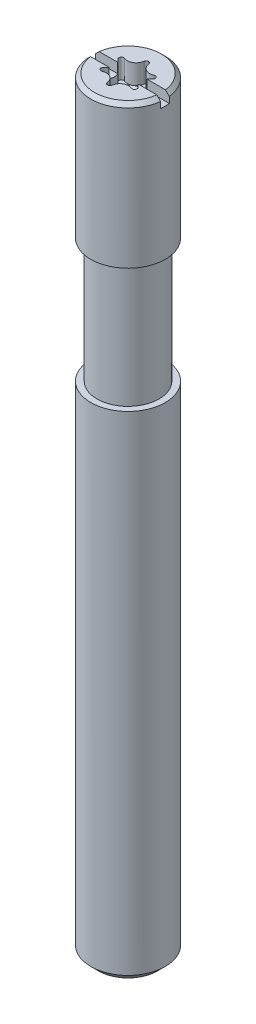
ISO-10303-21;
HEADER;
FILE_DESCRIPTION(('STEP AP214'),'2;1');
FILE_NAME('part.step','',(''),(''),'','','');
FILE_SCHEMA(('AUTOMOTIVE_DESIGN { 1 0 10303 214 1 1 1 1 }'));
ENDSEC;
DATA;
#1=APPLICATION_CONTEXT('core data for automotive mechanical design processes');
#2=APPLICATION_PROTOCOL_DEFINITION('international standard','automotive_design',2000,#1);
#3=PRODUCT_CONTEXT('',#1,'mechanical');
#4=PRODUCT('Part','Part','',(#3));
#5=PRODUCT_RELATED_PRODUCT_CATEGORY('part','',(#4));
#6=PRODUCT_DEFINITION_FORMATION('','',#4);
#7=PRODUCT_DEFINITION_CONTEXT('part definition',#1,'design');
#8=PRODUCT_DEFINITION('design','',#6,#7);
#9=PRODUCT_DEFINITION_SHAPE('','',#8);
#10=(LENGTH_UNIT() NAMED_UNIT(*) SI_UNIT(.MILLI.,.METRE.));
#11=(NAMED_UNIT(*) PLANE_ANGLE_UNIT() SI_UNIT($,.RADIAN.));
#12=(NAMED_UNIT(*) SI_UNIT($,.STERADIAN.) SOLID_ANGLE_UNIT());
#13=UNCERTAINTY_MEASURE_WITH_UNIT(LENGTH_MEASURE(1.E-05),#10,'distance_accuracy_value','');
#14=(GEOMETRIC_REPRESENTATION_CONTEXT(3) GLOBAL_UNCERTAINTY_ASSIGNED_CONTEXT((#13)) GLOBAL_UNIT_ASSIGNED_CONTEXT((#10,
#11,#12)) REPRESENTATION_CONTEXT('',''));
#15=CARTESIAN_POINT('',(0.,0.,0.));
#16=DIRECTION('',(0.,0.,1.));
#17=DIRECTION('',(1.,0.,0.));
#18=AXIS2_PLACEMENT_3D('',#15,#16,#17);
#19=CARTESIAN_POINT('',(-1.52237094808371,39.9,-0.362499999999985));
#20=DIRECTION('',(0.,1.,0.));
#21=DIRECTION('',(0.,0.,1.));
#22=AXIS2_PLACEMENT_3D('',#19,#20,#21);
#23=PLANE('',#22);
#24=CARTESIAN_POINT('',(-0.894502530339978,39.9,1.54932383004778));
#25=DIRECTION('',(0.,1.,0.));
#26=DIRECTION('',(0.,0.,1.));
#27=AXIS2_PLACEMENT_3D('',#24,#25,#26);
#28=CIRCLE('',#27,0.7);
#29=CARTESIAN_POINT('',(-0.198778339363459,39.9,1.47207196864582));
#30=VERTEX_POINT('',#29);
#31=CARTESIAN_POINT('',(-0.464026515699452,39.899999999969,0.997336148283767));
#32=VERTEX_POINT('',#31);
#33=EDGE_CURVE('E359',#30,#32,#28,.T.);
#34=ORIENTED_EDGE('',*,*,#33,.F.);
#35=CARTESIAN_POINT('',(0.,39.9,1.45));
#36=DIRECTION('',(0.,1.,0.));
#37=DIRECTION('',(0.,0.,1.));
#38=AXIS2_PLACEMENT_3D('',#35,#36,#37);
#39=CIRCLE('',#38,0.2);
#40=CARTESIAN_POINT('',(0.198778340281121,39.9,1.47207196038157));
#41=VERTEX_POINT('',#40);
#42=EDGE_CURVE('E565',#30,#41,#39,.T.);
#43=ORIENTED_EDGE('',*,*,#42,.T.);
#44=CARTESIAN_POINT('',(0.894502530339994,39.9,1.54932383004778));
#45=DIRECTION('',(0.,1.,0.));
#46=DIRECTION('',(0.,0.,1.));
#47=AXIS2_PLACEMENT_3D('',#44,#45,#46);
#48=CIRCLE('',#47,0.7);
#49=CARTESIAN_POINT('',(0.464026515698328,39.8999999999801,0.997336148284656));
#50=VERTEX_POINT('',#49);
#51=EDGE_CURVE('E631',#50,#41,#48,.T.);
#52=ORIENTED_EDGE('',*,*,#51,.F.);
#53=CARTESIAN_POINT('',(0.,39.8999999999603,0.));
#54=DIRECTION('',(0.,1.,0.));
#55=DIRECTION('',(0.,0.,1.));
#56=AXIS2_PLACEMENT_3D('',#53,#54,#55);
#57=CIRCLE('',#56,1.09999999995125);
#58=EDGE_CURVE('E592',#50,#32,#57,.F.);
#59=ORIENTED_EDGE('',*,*,#58,.T.);
#60=EDGE_LOOP('',(#34,#43,#52,#59));
#61=FACE_BOUND('',#60,.T.);
#62=ADVANCED_FACE('F14',(#61),#23,.T.);
#63=CARTESIAN_POINT('',(-1.52237094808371,39.9,-0.362499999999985));
#64=DIRECTION('',(0.,1.,0.));
#65=DIRECTION('',(0.,0.,1.));
#66=AXIS2_PLACEMENT_3D('',#63,#64,#65);
#67=PLANE('',#66);
#68=CARTESIAN_POINT('',(0.894502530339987,39.9,-1.54932383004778));
#69=DIRECTION('',(0.,1.,0.));
#70=DIRECTION('',(0.,0.,1.));
#71=AXIS2_PLACEMENT_3D('',#68,#69,#70);
#72=CIRCLE('',#71,0.7);
#73=CARTESIAN_POINT('',(0.198778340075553,39.9,-1.47207196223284));
#74=VERTEX_POINT('',#73);
#75=CARTESIAN_POINT('',(0.464026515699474,39.899999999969,-0.997336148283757));
#76=VERTEX_POINT('',#75);
#77=EDGE_CURVE('E628',#74,#76,#72,.T.);
#78=ORIENTED_EDGE('',*,*,#77,.F.);
#79=CARTESIAN_POINT('',(0.,39.9,-1.45));
#80=DIRECTION('',(0.,1.,0.));
#81=DIRECTION('',(0.,0.,1.));
#82=AXIS2_PLACEMENT_3D('',#79,#80,#81);
#83=CIRCLE('',#82,0.2);
#84=CARTESIAN_POINT('',(-0.198778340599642,39.9,-1.47207195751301));
#85=VERTEX_POINT('',#84);
#86=EDGE_CURVE('E640',#74,#85,#83,.T.);
#87=ORIENTED_EDGE('',*,*,#86,.T.);
#88=CARTESIAN_POINT('',(-0.894502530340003,39.9,-1.54932383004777));
#89=DIRECTION('',(0.,1.,0.));
#90=DIRECTION('',(0.,0.,1.));
#91=AXIS2_PLACEMENT_3D('',#88,#89,#90);
#92=CIRCLE('',#91,0.7);
#93=CARTESIAN_POINT('',(-0.46402651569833,39.8999999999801,-0.997336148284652));
#94=VERTEX_POINT('',#93);
#95=EDGE_CURVE('E279',#94,#85,#92,.T.);
#96=ORIENTED_EDGE('',*,*,#95,.F.);
#97=CARTESIAN_POINT('',(0.,39.8999999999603,0.));
#98=DIRECTION('',(0.,1.,0.));
#99=DIRECTION('',(0.,0.,1.));
#100=AXIS2_PLACEMENT_3D('',#97,#98,#99);
#101=CIRCLE('',#100,1.09999999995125);
#102=EDGE_CURVE('E644',#94,#76,#101,.F.);
#103=ORIENTED_EDGE('',*,*,#102,.T.);
#104=EDGE_LOOP('',(#78,#87,#96,#103));
#105=FACE_BOUND('',#104,.T.);
#106=ADVANCED_FACE('F314',(#105),#67,.T.);
#107=CARTESIAN_POINT('',(0.894502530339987,39.9,-1.54932383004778));
#108=DIRECTION('',(0.,1.,0.));
#109=DIRECTION('',(0.,0.,1.));
#110=AXIS2_PLACEMENT_3D('',#107,#108,#109);
#111=CYLINDRICAL_SURFACE('',#110,0.7);
#112=CARTESIAN_POINT('',(0.894502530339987,39.9,-1.54932383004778));
#113=DIRECTION('',(0.,1.,0.));
#114=DIRECTION('',(0.,0.,1.));
#115=AXIS2_PLACEMENT_3D('',#112,#113,#114);
#116=CIRCLE('',#115,0.7);
#117=CARTESIAN_POINT('',(0.631705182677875,39.8999999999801,-0.900526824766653));
#118=VERTEX_POINT('',#117);
#119=CARTESIAN_POINT('',(1.17546254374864,39.9,-0.908183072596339));
#120=VERTEX_POINT('',#119);
#121=EDGE_CURVE('E624',#118,#120,#116,.T.);
#122=ORIENTED_EDGE('',*,*,#121,.T.);
#123=DIRECTION('',(0.,1.,0.));
#124=VECTOR('',#123,1.);
#125=CARTESIAN_POINT('',(1.17546254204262,39.9,-0.908183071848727));
#126=LINE('',#125,#124);
#127=CARTESIAN_POINT('',(1.17546254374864,41.5,-0.908183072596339));
#128=VERTEX_POINT('',#127);
#129=EDGE_CURVE('E555',#120,#128,#126,.T.);
#130=ORIENTED_EDGE('',*,*,#129,.T.);
#131=CARTESIAN_POINT('',(0.894502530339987,41.5,-1.54932383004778));
#132=DIRECTION('',(0.,1.,0.));
#133=DIRECTION('',(0.,0.,1.));
#134=AXIS2_PLACEMENT_3D('',#131,#132,#133);
#135=CIRCLE('',#134,0.7);
#136=CARTESIAN_POINT('',(0.198778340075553,41.5,-1.47207196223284));
#137=VERTEX_POINT('',#136);
#138=EDGE_CURVE('E435',#128,#137,#135,.F.);
#139=ORIENTED_EDGE('',*,*,#138,.T.);
#140=DIRECTION('',(0.,1.,0.));
#141=VECTOR('',#140,1.);
#142=CARTESIAN_POINT('',(0.198778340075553,39.9,-1.47207196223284));
#143=LINE('',#142,#141);
#144=EDGE_CURVE('E625',#137,#74,#143,.F.);
#145=ORIENTED_EDGE('',*,*,#144,.T.);
#146=ORIENTED_EDGE('',*,*,#77,.T.);
#147=CARTESIAN_POINT('',(0.46402651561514,39.8999999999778,-0.997336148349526));
#148=CARTESIAN_POINT('',(0.489730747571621,39.8973321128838,-0.977317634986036));
#149=CARTESIAN_POINT('',(0.516556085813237,39.8959981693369,-0.959240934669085));
#150=CARTESIAN_POINT('',(0.572448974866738,39.8959981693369,-0.92697116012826));
#151=CARTESIAN_POINT('',(0.601516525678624,39.8973321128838,-0.912778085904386));
#152=CARTESIAN_POINT('',(0.631705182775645,39.8999999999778,-0.900526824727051));
#153=B_SPLINE_CURVE_WITH_KNOTS('',3,(#147,#148,#149,#150,#151,#152),.UNSPECIFIED.,.F.,.F.,(4,2,
4),(0.,0.097125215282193,0.194250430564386),.UNSPECIFIED.);
#154=EDGE_CURVE('E334',#76,#118,#153,.T.);
#155=ORIENTED_EDGE('',*,*,#154,.T.);
#156=EDGE_LOOP('',(#122,#130,#139,#145,#146,#155));
#157=FACE_BOUND('',#156,.T.);
#158=ADVANCED_FACE('F293',(#157),#111,.T.);
#159=CARTESIAN_POINT('',(0.,39.9,-1.45));
#160=DIRECTION('',(0.,1.,0.));
#161=DIRECTION('',(0.,0.,1.));
#162=AXIS2_PLACEMENT_3D('',#159,#160,#161);
#163=CYLINDRICAL_SURFACE('',#162,0.2);
#164=DIRECTION('',(0.,1.,0.));
#165=VECTOR('',#164,1.);
#166=CARTESIAN_POINT('',(-0.198778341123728,39.9,-1.47207195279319));
#167=LINE('',#166,#165);
#168=CARTESIAN_POINT('',(-0.198778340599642,41.5,-1.47207195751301));
#169=VERTEX_POINT('',#168);
#170=EDGE_CURVE('E455',#85,#169,#167,.T.);
#171=ORIENTED_EDGE('',*,*,#170,.F.);
#172=ORIENTED_EDGE('',*,*,#86,.F.);
#173=ORIENTED_EDGE('',*,*,#144,.F.);
#174=CARTESIAN_POINT('',(0.,41.5,-1.45));
#175=DIRECTION('',(0.,1.,0.));
#176=DIRECTION('',(0.,0.,1.));
#177=AXIS2_PLACEMENT_3D('',#174,#175,#176);
#178=CIRCLE('',#177,0.2);
#179=EDGE_CURVE('E639',#169,#137,#178,.F.);
#180=ORIENTED_EDGE('',*,*,#179,.F.);
#181=EDGE_LOOP('',(#171,#172,#173,#180));
#182=FACE_BOUND('',#181,.T.);
#183=ADVANCED_FACE('F291',(#182),#163,.F.);
#184=CARTESIAN_POINT('',(-0.894502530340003,39.9,-1.54932383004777));
#185=DIRECTION('',(0.,1.,0.));
#186=DIRECTION('',(0.,0.,1.));
#187=AXIS2_PLACEMENT_3D('',#184,#185,#186);
#188=CYLINDRICAL_SURFACE('',#187,0.7);
#189=ORIENTED_EDGE('',*,*,#95,.T.);
#190=ORIENTED_EDGE('',*,*,#170,.T.);
#191=CARTESIAN_POINT('',(-0.894502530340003,41.5,-1.54932383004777));
#192=DIRECTION('',(0.,1.,0.));
#193=DIRECTION('',(0.,0.,1.));
#194=AXIS2_PLACEMENT_3D('',#191,#192,#193);
#195=CIRCLE('',#194,0.7);
#196=CARTESIAN_POINT('',(-1.17546253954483,41.5,-0.908183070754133));
#197=VERTEX_POINT('',#196);
#198=EDGE_CURVE('E432',#169,#197,#195,.F.);
#199=ORIENTED_EDGE('',*,*,#198,.T.);
#200=DIRECTION('',(0.,1.,0.));
#201=VECTOR('',#200,1.);
#202=CARTESIAN_POINT('',(-1.17546253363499,39.9,-0.908183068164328));
#203=LINE('',#202,#201);
#204=CARTESIAN_POINT('',(-1.17546253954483,39.9,-0.908183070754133));
#205=VERTEX_POINT('',#204);
#206=EDGE_CURVE('E612',#197,#205,#203,.F.);
#207=ORIENTED_EDGE('',*,*,#206,.T.);
#208=CARTESIAN_POINT('',(-0.894502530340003,39.9,-1.54932383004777));
#209=DIRECTION('',(0.,1.,0.));
#210=DIRECTION('',(0.,0.,1.));
#211=AXIS2_PLACEMENT_3D('',#208,#209,#210);
#212=CIRCLE('',#211,0.7);
#213=CARTESIAN_POINT('',(-0.631705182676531,39.899999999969,-0.900526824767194));
#214=VERTEX_POINT('',#213);
#215=EDGE_CURVE('E304',#205,#214,#212,.T.);
#216=ORIENTED_EDGE('',*,*,#215,.T.);
#217=CARTESIAN_POINT('',(-0.631705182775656,39.8999999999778,-0.900526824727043));
#218=CARTESIAN_POINT('',(-0.601516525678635,39.8973321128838,-0.912778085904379));
#219=CARTESIAN_POINT('',(-0.572448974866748,39.8959981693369,-0.926971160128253));
#220=CARTESIAN_POINT('',(-0.516556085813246,39.8959981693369,-0.959240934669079));
#221=CARTESIAN_POINT('',(-0.48973074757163,39.8973321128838,-0.977317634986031));
#222=CARTESIAN_POINT('',(-0.464026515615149,39.8999999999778,-0.997336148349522));
#223=B_SPLINE_CURVE_WITH_KNOTS('',3,(#217,#218,#219,#220,#221,#222),.UNSPECIFIED.,.F.,.F.,(4,2,
4),(0.,0.0971252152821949,0.19425043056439),.UNSPECIFIED.);
#224=EDGE_CURVE('E296',#214,#94,#223,.T.);
#225=ORIENTED_EDGE('',*,*,#224,.T.);
#226=EDGE_LOOP('',(#189,#190,#199,#207,#216,#225));
#227=FACE_BOUND('',#226,.T.);
#228=ADVANCED_FACE('F286',(#227),#188,.T.);
#229=CARTESIAN_POINT('',(-1.25573683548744,39.9,-0.724999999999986));
#230=DIRECTION('',(0.,1.,0.));
#231=DIRECTION('',(0.,0.,1.));
#232=AXIS2_PLACEMENT_3D('',#229,#230,#231);
#233=CYLINDRICAL_SURFACE('',#232,0.2);
#234=DIRECTION('',(0.,1.,0.));
#235=VECTOR('',#234,1.);
#236=CARTESIAN_POINT('',(-1.37424087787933,39.9,-0.563888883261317));
#237=LINE('',#236,#235);
#238=CARTESIAN_POINT('',(-1.37424088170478,39.9,-0.563888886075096));
#239=VERTEX_POINT('',#238);
#240=CARTESIAN_POINT('',(-1.37424088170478,41.5,-0.563888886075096));
#241=VERTEX_POINT('',#240);
#242=EDGE_CURVE('E466',#239,#241,#237,.T.);
#243=ORIENTED_EDGE('',*,*,#242,.F.);
#244=CARTESIAN_POINT('',(-1.25573683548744,39.9,-0.724999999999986));
#245=DIRECTION('',(0.,1.,0.));
#246=DIRECTION('',(0.,0.,1.));
#247=AXIS2_PLACEMENT_3D('',#244,#245,#246);
#248=CIRCLE('',#247,0.2);
#249=EDGE_CURVE('E606',#205,#239,#248,.T.);
#250=ORIENTED_EDGE('',*,*,#249,.F.);
#251=ORIENTED_EDGE('',*,*,#206,.F.);
#252=CARTESIAN_POINT('',(-1.25573683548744,41.5,-0.724999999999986));
#253=DIRECTION('',(0.,1.,0.));
#254=DIRECTION('',(0.,0.,1.));
#255=AXIS2_PLACEMENT_3D('',#252,#253,#254);
#256=CIRCLE('',#255,0.2);
#257=EDGE_CURVE('E469',#241,#197,#256,.F.);
#258=ORIENTED_EDGE('',*,*,#257,.F.);
#259=EDGE_LOOP('',(#243,#250,#251,#258));
#260=FACE_BOUND('',#259,.T.);
#261=ADVANCED_FACE('F290',(#260),#233,.F.);
#262=CARTESIAN_POINT('',(-1.52237094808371,39.9,-0.362499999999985));
#263=DIRECTION('',(0.,1.,0.));
#264=DIRECTION('',(0.,0.,1.));
#265=AXIS2_PLACEMENT_3D('',#262,#263,#264);
#266=PLANE('',#265);
#267=ORIENTED_EDGE('',*,*,#215,.F.);
#268=ORIENTED_EDGE('',*,*,#249,.T.);
#269=CARTESIAN_POINT('',(-1.78900506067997,39.9,0.));
#270=DIRECTION('',(0.,1.,0.));
#271=DIRECTION('',(0.,0.,1.));
#272=AXIS2_PLACEMENT_3D('',#269,#270,#271);
#273=CIRCLE('',#272,0.7);
#274=CARTESIAN_POINT('',(-1.09573169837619,39.8999999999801,-0.0968093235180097));
#275=VERTEX_POINT('',#274);
#276=EDGE_CURVE('E513',#275,#239,#273,.T.);
#277=ORIENTED_EDGE('',*,*,#276,.F.);
#278=CARTESIAN_POINT('',(0.,39.8999999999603,0.));
#279=DIRECTION('',(0.,1.,0.));
#280=DIRECTION('',(0.,0.,1.));
#281=AXIS2_PLACEMENT_3D('',#278,#279,#280);
#282=CIRCLE('',#281,1.09999999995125);
#283=EDGE_CURVE('E597',#275,#214,#282,.F.);
#284=ORIENTED_EDGE('',*,*,#283,.T.);
#285=EDGE_LOOP('',(#267,#268,#277,#284));
#286=FACE_BOUND('',#285,.T.);
#287=ADVANCED_FACE('F316',(#286),#266,.T.);
#288=CARTESIAN_POINT('',(-1.52237094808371,39.9,-0.362499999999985));
#289=DIRECTION('',(0.,1.,0.));
#290=DIRECTION('',(0.,0.,1.));
#291=AXIS2_PLACEMENT_3D('',#288,#289,#290);
#292=PLANE('',#291);
#293=CARTESIAN_POINT('',(-1.78900506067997,39.9,0.));
#294=DIRECTION('',(0.,1.,0.));
#295=DIRECTION('',(0.,0.,1.));
#296=AXIS2_PLACEMENT_3D('',#293,#294,#295);
#297=CIRCLE('',#296,0.7);
#298=CARTESIAN_POINT('',(-1.09573169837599,39.8999999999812,0.0968093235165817));
#299=VERTEX_POINT('',#298);
#300=CARTESIAN_POINT('',(-1.37424089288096,39.9,0.563888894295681));
#301=VERTEX_POINT('',#300);
#302=EDGE_CURVE('E461',#299,#301,#297,.F.);
#303=ORIENTED_EDGE('',*,*,#302,.T.);
#304=CARTESIAN_POINT('',(-1.25573683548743,39.9,0.725000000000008));
#305=DIRECTION('',(0.,1.,0.));
#306=DIRECTION('',(0.,0.,1.));
#307=AXIS2_PLACEMENT_3D('',#304,#305,#306);
#308=CIRCLE('',#307,0.2);
#309=CARTESIAN_POINT('',(-1.17546254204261,39.9,0.90818307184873));
#310=VERTEX_POINT('',#309);
#311=EDGE_CURVE('E482',#301,#310,#308,.T.);
#312=ORIENTED_EDGE('',*,*,#311,.T.);
#313=CARTESIAN_POINT('',(-0.894502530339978,39.9,1.54932383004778));
#314=DIRECTION('',(0.,1.,0.));
#315=DIRECTION('',(0.,0.,1.));
#316=AXIS2_PLACEMENT_3D('',#313,#314,#315);
#317=CIRCLE('',#316,0.7);
#318=CARTESIAN_POINT('',(-0.631705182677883,39.8999999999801,0.900526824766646));
#319=VERTEX_POINT('',#318);
#320=EDGE_CURVE('E358',#319,#310,#317,.T.);
#321=ORIENTED_EDGE('',*,*,#320,.F.);
#322=CARTESIAN_POINT('',(0.,39.8999999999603,0.));
#323=DIRECTION('',(0.,1.,0.));
#324=DIRECTION('',(0.,0.,1.));
#325=AXIS2_PLACEMENT_3D('',#322,#323,#324);
#326=CIRCLE('',#325,1.09999999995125);
#327=EDGE_CURVE('E594',#319,#299,#326,.F.);
#328=ORIENTED_EDGE('',*,*,#327,.T.);
#329=EDGE_LOOP('',(#303,#312,#321,#328));
#330=FACE_BOUND('',#329,.T.);
#331=ADVANCED_FACE('F527',(#330),#292,.T.);
#332=CARTESIAN_POINT('',(-1.25573683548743,39.9,0.725000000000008));
#333=DIRECTION('',(0.,1.,0.));
#334=DIRECTION('',(0.,0.,1.));
#335=AXIS2_PLACEMENT_3D('',#332,#333,#334);
#336=CYLINDRICAL_SURFACE('',#335,0.2);
#337=DIRECTION('',(0.,1.,0.));
#338=VECTOR('',#337,1.);
#339=CARTESIAN_POINT('',(-1.17546253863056,39.9,0.908183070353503));
#340=LINE('',#339,#338);
#341=CARTESIAN_POINT('',(-1.17546254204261,41.5,0.90818307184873));
#342=VERTEX_POINT('',#341);
#343=EDGE_CURVE('E584',#310,#342,#340,.T.);
#344=ORIENTED_EDGE('',*,*,#343,.F.);
#345=ORIENTED_EDGE('',*,*,#311,.F.);
#346=DIRECTION('',(0.,1.,0.));
#347=VECTOR('',#346,1.);
#348=CARTESIAN_POINT('',(-1.3742409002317,39.9,0.563888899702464));
#349=LINE('',#348,#347);
#350=CARTESIAN_POINT('',(-1.37424089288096,41.5,0.563888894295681));
#351=VERTEX_POINT('',#350);
#352=EDGE_CURVE('E480',#351,#301,#349,.F.);
#353=ORIENTED_EDGE('',*,*,#352,.F.);
#354=CARTESIAN_POINT('',(-1.25573683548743,41.5,0.725000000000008));
#355=DIRECTION('',(0.,1.,0.));
#356=DIRECTION('',(0.,0.,1.));
#357=AXIS2_PLACEMENT_3D('',#354,#355,#356);
#358=CIRCLE('',#357,0.2);
#359=EDGE_CURVE('E479',#342,#351,#358,.F.);
#360=ORIENTED_EDGE('',*,*,#359,.F.);
#361=EDGE_LOOP('',(#344,#345,#353,#360));
#362=FACE_BOUND('',#361,.T.);
#363=ADVANCED_FACE('F366',(#362),#336,.F.);
#364=CARTESIAN_POINT('',(-0.894502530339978,39.9,1.54932383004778));
#365=DIRECTION('',(0.,1.,0.));
#366=DIRECTION('',(0.,0.,1.));
#367=AXIS2_PLACEMENT_3D('',#364,#365,#366);
#368=CYLINDRICAL_SURFACE('',#367,0.7);
#369=ORIENTED_EDGE('',*,*,#320,.T.);
#370=ORIENTED_EDGE('',*,*,#343,.T.);
#371=CARTESIAN_POINT('',(-0.894502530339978,41.5,1.54932383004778));
#372=DIRECTION('',(0.,1.,0.));
#373=DIRECTION('',(0.,0.,1.));
#374=AXIS2_PLACEMENT_3D('',#371,#372,#373);
#375=CIRCLE('',#374,0.7);
#376=CARTESIAN_POINT('',(-0.198778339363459,41.5,1.47207196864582));
#377=VERTEX_POINT('',#376);
#378=EDGE_CURVE('E277',#342,#377,#375,.F.);
#379=ORIENTED_EDGE('',*,*,#378,.T.);
#380=DIRECTION('',(0.,1.,0.));
#381=VECTOR('',#380,1.);
#382=CARTESIAN_POINT('',(-0.198778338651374,39.9,1.4720719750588));
#383=LINE('',#382,#381);
#384=EDGE_CURVE('E633',#377,#30,#383,.F.);
#385=ORIENTED_EDGE('',*,*,#384,.T.);
#386=ORIENTED_EDGE('',*,*,#33,.T.);
#387=CARTESIAN_POINT('',(-0.464026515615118,39.8999999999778,0.997336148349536));
#388=CARTESIAN_POINT('',(-0.489730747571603,39.8973321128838,0.977317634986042));
#389=CARTESIAN_POINT('',(-0.516556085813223,39.8959981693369,0.959240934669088));
#390=CARTESIAN_POINT('',(-0.572448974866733,39.8959981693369,0.926971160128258));
#391=CARTESIAN_POINT('',(-0.601516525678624,39.8973321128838,0.912778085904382));
#392=CARTESIAN_POINT('',(-0.63170518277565,39.8999999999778,0.900526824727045));
#393=B_SPLINE_CURVE_WITH_KNOTS('',3,(#387,#388,#389,#390,#391,#392),.UNSPECIFIED.,.F.,.F.,(4,2,
4),(0.,0.0971252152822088,0.194250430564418),.UNSPECIFIED.);
#394=EDGE_CURVE('E349',#32,#319,#393,.T.);
#395=ORIENTED_EDGE('',*,*,#394,.T.);
#396=EDGE_LOOP('',(#369,#370,#379,#385,#386,#395));
#397=FACE_BOUND('',#396,.T.);
#398=ADVANCED_FACE('F361',(#397),#368,.T.);
#399=CARTESIAN_POINT('',(0.,39.9,1.45));
#400=DIRECTION('',(0.,1.,0.));
#401=DIRECTION('',(0.,0.,1.));
#402=AXIS2_PLACEMENT_3D('',#399,#400,#401);
#403=CYLINDRICAL_SURFACE('',#402,0.2);
#404=DIRECTION('',(0.,1.,0.));
#405=VECTOR('',#404,1.);
#406=CARTESIAN_POINT('',(0.198778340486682,39.9,1.4720719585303));
#407=LINE('',#406,#405);
#408=CARTESIAN_POINT('',(0.198778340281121,41.5,1.47207196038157));
#409=VERTEX_POINT('',#408);
#410=EDGE_CURVE('E629',#41,#409,#407,.T.);
#411=ORIENTED_EDGE('',*,*,#410,.F.);
#412=ORIENTED_EDGE('',*,*,#42,.F.);
#413=ORIENTED_EDGE('',*,*,#384,.F.);
#414=CARTESIAN_POINT('',(0.,41.5,1.45));
#415=DIRECTION('',(0.,1.,0.));
#416=DIRECTION('',(0.,0.,1.));
#417=AXIS2_PLACEMENT_3D('',#414,#415,#416);
#418=CIRCLE('',#417,0.2);
#419=EDGE_CURVE('E563',#409,#377,#418,.F.);
#420=ORIENTED_EDGE('',*,*,#419,.F.);
#421=EDGE_LOOP('',(#411,#412,#413,#420));
#422=FACE_BOUND('',#421,.T.);
#423=ADVANCED_FACE('F365',(#422),#403,.F.);
#424=CARTESIAN_POINT('',(0.894502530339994,39.9,1.54932383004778));
#425=DIRECTION('',(0.,1.,0.));
#426=DIRECTION('',(0.,0.,1.));
#427=AXIS2_PLACEMENT_3D('',#424,#425,#426);
#428=CYLINDRICAL_SURFACE('',#427,0.7);
#429=ORIENTED_EDGE('',*,*,#51,.T.);
#430=ORIENTED_EDGE('',*,*,#410,.T.);
#431=CARTESIAN_POINT('',(0.894502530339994,41.5,1.54932383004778));
#432=DIRECTION('',(0.,1.,0.));
#433=DIRECTION('',(0.,0.,1.));
#434=AXIS2_PLACEMENT_3D('',#431,#432,#433);
#435=CIRCLE('',#434,0.7);
#436=CARTESIAN_POINT('',(1.17546253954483,41.5,0.908183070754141));
#437=VERTEX_POINT('',#436);
#438=EDGE_CURVE('E437',#409,#437,#435,.F.);
#439=ORIENTED_EDGE('',*,*,#438,.T.);
#440=DIRECTION('',(0.,1.,0.));
#441=VECTOR('',#440,1.);
#442=CARTESIAN_POINT('',(1.17546253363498,39.9,0.908183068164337));
#443=LINE('',#442,#441);
#444=CARTESIAN_POINT('',(1.17546253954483,39.9,0.908183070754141));
#445=VERTEX_POINT('',#444);
#446=EDGE_CURVE('E585',#437,#445,#443,.F.);
#447=ORIENTED_EDGE('',*,*,#446,.T.);
#448=CARTESIAN_POINT('',(0.894502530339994,39.9,1.54932383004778));
#449=DIRECTION('',(0.,1.,0.));
#450=DIRECTION('',(0.,0.,1.));
#451=AXIS2_PLACEMENT_3D('',#448,#449,#450);
#452=CIRCLE('',#451,0.7);
#453=CARTESIAN_POINT('',(0.631705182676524,39.899999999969,0.900526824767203));
#454=VERTEX_POINT('',#453);
#455=EDGE_CURVE('E632',#445,#454,#452,.T.);
#456=ORIENTED_EDGE('',*,*,#455,.T.);
#457=CARTESIAN_POINT('',(0.631705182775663,39.8999999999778,0.900526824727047));
#458=CARTESIAN_POINT('',(0.601516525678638,39.8973321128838,0.912778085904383));
#459=CARTESIAN_POINT('',(0.572448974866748,39.8959981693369,0.926971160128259));
#460=CARTESIAN_POINT('',(0.516556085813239,39.8959981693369,0.959240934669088));
#461=CARTESIAN_POINT('',(0.48973074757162,39.8973321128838,0.977317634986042));
#462=CARTESIAN_POINT('',(0.464026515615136,39.8999999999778,0.997336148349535));
#463=B_SPLINE_CURVE_WITH_KNOTS('',3,(#457,#458,#459,#460,#461,#462),.UNSPECIFIED.,.F.,.F.,(4,2,
4),(0.,0.097125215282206,0.194250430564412),.UNSPECIFIED.);
#464=EDGE_CURVE('E341',#454,#50,#463,.T.);
#465=ORIENTED_EDGE('',*,*,#464,.T.);
#466=EDGE_LOOP('',(#429,#430,#439,#447,#456,#465));
#467=FACE_BOUND('',#466,.T.);
#468=ADVANCED_FACE('F368',(#467),#428,.T.);
#469=CARTESIAN_POINT('',(-1.52237094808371,39.9,-0.362499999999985));
#470=DIRECTION('',(0.,1.,0.));
#471=DIRECTION('',(0.,0.,1.));
#472=AXIS2_PLACEMENT_3D('',#469,#470,#471);
#473=PLANE('',#472);
#474=ORIENTED_EDGE('',*,*,#455,.F.);
#475=CARTESIAN_POINT('',(1.25573683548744,39.9,0.725));
#476=DIRECTION('',(0.,1.,0.));
#477=DIRECTION('',(0.,0.,1.));
#478=AXIS2_PLACEMENT_3D('',#475,#476,#477);
#479=CIRCLE('',#478,0.2);
#480=CARTESIAN_POINT('',(1.37424088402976,39.9,0.563888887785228));
#481=VERTEX_POINT('',#480);
#482=EDGE_CURVE('E567',#445,#481,#479,.T.);
#483=ORIENTED_EDGE('',*,*,#482,.T.);
#484=CARTESIAN_POINT('',(1.78900506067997,39.9,0.));
#485=DIRECTION('',(0.,1.,0.));
#486=DIRECTION('',(0.,0.,1.));
#487=AXIS2_PLACEMENT_3D('',#484,#485,#486);
#488=CIRCLE('',#487,0.7);
#489=CARTESIAN_POINT('',(1.09573169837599,39.8999999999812,0.0968093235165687));
#490=VERTEX_POINT('',#489);
#491=EDGE_CURVE('E570',#481,#490,#488,.F.);
#492=ORIENTED_EDGE('',*,*,#491,.T.);
#493=CARTESIAN_POINT('',(0.,39.8999999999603,0.));
#494=DIRECTION('',(0.,1.,0.));
#495=DIRECTION('',(0.,0.,1.));
#496=AXIS2_PLACEMENT_3D('',#493,#494,#495);
#497=CIRCLE('',#496,1.09999999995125);
#498=EDGE_CURVE('E601',#490,#454,#497,.F.);
#499=ORIENTED_EDGE('',*,*,#498,.T.);
#500=EDGE_LOOP('',(#474,#483,#492,#499));
#501=FACE_BOUND('',#500,.T.);
#502=ADVANCED_FACE('F312',(#501),#473,.T.);
#503=CARTESIAN_POINT('',(0.,39.8999999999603,0.));
#504=DIRECTION('',(0.,1.,0.));
#505=DIRECTION('',(0.,0.,1.));
#506=AXIS2_PLACEMENT_3D('',#503,#504,#505);
#507=CONICAL_SURFACE('',#506,1.09999999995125,1.22173047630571);
#508=CARTESIAN_POINT('',(1.13686837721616E-10,39.4996327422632,0.));
#509=VERTEX_POINT('',#508);
#510=VERTEX_LOOP('',#509);
#511=FACE_BOUND('',#510,.T.);
#512=CARTESIAN_POINT('',(0.,39.8999999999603,0.));
#513=DIRECTION('',(0.,1.,0.));
#514=DIRECTION('',(0.,0.,1.));
#515=AXIS2_PLACEMENT_3D('',#512,#513,#514);
#516=CIRCLE('',#515,1.09999999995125);
#517=CARTESIAN_POINT('',(1.09573169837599,39.8999999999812,-0.0968093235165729));
#518=VERTEX_POINT('',#517);
#519=EDGE_CURVE('E599',#118,#518,#516,.F.);
#520=ORIENTED_EDGE('',*,*,#519,.F.);
#521=ORIENTED_EDGE('',*,*,#154,.F.);
#522=ORIENTED_EDGE('',*,*,#102,.F.);
#523=ORIENTED_EDGE('',*,*,#224,.F.);
#524=ORIENTED_EDGE('',*,*,#283,.F.);
#525=CARTESIAN_POINT('',(-1.09573169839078,39.8999999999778,0.0968093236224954));
#526=CARTESIAN_POINT('',(-1.09124727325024,39.8973321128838,0.0645395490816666));
#527=CARTESIAN_POINT('',(-1.08900506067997,39.8959981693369,0.0322697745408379));
#528=CARTESIAN_POINT('',(-1.08900506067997,39.8959981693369,-0.0322697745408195));
#529=CARTESIAN_POINT('',(-1.09124727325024,39.8973321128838,-0.0645395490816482));
#530=CARTESIAN_POINT('',(-1.09573169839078,39.8999999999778,-0.0968093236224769));
#531=B_SPLINE_CURVE_WITH_KNOTS('',3,(#525,#526,#527,#528,#529,#530),.UNSPECIFIED.,.F.,.F.,(4,2,
4),(0.,0.097125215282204,0.194250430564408),.UNSPECIFIED.);
#532=EDGE_CURVE('E321',#299,#275,#531,.T.);
#533=ORIENTED_EDGE('',*,*,#532,.F.);
#534=ORIENTED_EDGE('',*,*,#327,.F.);
#535=ORIENTED_EDGE('',*,*,#394,.F.);
#536=ORIENTED_EDGE('',*,*,#58,.F.);
#537=ORIENTED_EDGE('',*,*,#464,.F.);
#538=ORIENTED_EDGE('',*,*,#498,.F.);
#539=CARTESIAN_POINT('',(1.09573169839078,39.8999999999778,-0.0968093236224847));
#540=CARTESIAN_POINT('',(1.09124727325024,39.8973321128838,-0.0645395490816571));
#541=CARTESIAN_POINT('',(1.08900506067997,39.8959981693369,-0.0322697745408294));
#542=CARTESIAN_POINT('',(1.08900506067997,39.8959981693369,0.0322697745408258));
#543=CARTESIAN_POINT('',(1.09124727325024,39.8973321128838,0.0645395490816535));
#544=CARTESIAN_POINT('',(1.09573169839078,39.8999999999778,0.0968093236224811));
#545=B_SPLINE_CURVE_WITH_KNOTS('',3,(#539,#540,#541,#542,#543,#544),.UNSPECIFIED.,.F.,.F.,(4,2,
4),(0.,0.0971252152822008,0.194250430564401),.UNSPECIFIED.);
#546=EDGE_CURVE('E535',#518,#490,#545,.T.);
#547=ORIENTED_EDGE('',*,*,#546,.F.);
#548=EDGE_LOOP('',(#520,#521,#522,#523,#524,#533,#534,#535,#536,#537,#538,#547));
#549=FACE_BOUND('',#548,.T.);
#550=ADVANCED_FACE('F306',(#511,#549),#507,.F.);
#551=CARTESIAN_POINT('',(-1.52237094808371,39.9,-0.362499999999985));
#552=DIRECTION('',(0.,1.,0.));
#553=DIRECTION('',(0.,0.,1.));
#554=AXIS2_PLACEMENT_3D('',#551,#552,#553);
#555=PLANE('',#554);
#556=CARTESIAN_POINT('',(1.78900506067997,39.9,0.));
#557=DIRECTION('',(0.,1.,0.));
#558=DIRECTION('',(0.,0.,1.));
#559=AXIS2_PLACEMENT_3D('',#556,#557,#558);
#560=CIRCLE('',#559,0.7);
#561=CARTESIAN_POINT('',(1.37424088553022,39.9,-0.563888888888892));
#562=VERTEX_POINT('',#561);
#563=EDGE_CURVE('E474',#518,#562,#560,.F.);
#564=ORIENTED_EDGE('',*,*,#563,.T.);
#565=CARTESIAN_POINT('',(1.25573683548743,39.9,-0.725));
#566=DIRECTION('',(0.,1.,0.));
#567=DIRECTION('',(0.,0.,1.));
#568=AXIS2_PLACEMENT_3D('',#565,#566,#567);
#569=CIRCLE('',#568,0.2);
#570=EDGE_CURVE('E473',#562,#120,#569,.T.);
#571=ORIENTED_EDGE('',*,*,#570,.T.);
#572=ORIENTED_EDGE('',*,*,#121,.F.);
#573=ORIENTED_EDGE('',*,*,#519,.T.);
#574=EDGE_LOOP('',(#564,#571,#572,#573));
#575=FACE_BOUND('',#574,.T.);
#576=ADVANCED_FACE('F311',(#575),#555,.T.);
#577=CARTESIAN_POINT('',(1.25573683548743,39.9,-0.725));
#578=DIRECTION('',(0.,1.,0.));
#579=DIRECTION('',(0.,0.,1.));
#580=AXIS2_PLACEMENT_3D('',#577,#578,#579);
#581=CYLINDRICAL_SURFACE('',#580,0.2);
#582=ORIENTED_EDGE('',*,*,#129,.F.);
#583=ORIENTED_EDGE('',*,*,#570,.F.);
#584=DIRECTION('',(0.,1.,0.));
#585=VECTOR('',#584,1.);
#586=CARTESIAN_POINT('',(1.37424088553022,39.9,-0.563888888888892));
#587=LINE('',#586,#585);
#588=CARTESIAN_POINT('',(1.37424088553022,41.5,-0.563888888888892));
#589=VERTEX_POINT('',#588);
#590=EDGE_CURVE('E471',#589,#562,#587,.F.);
#591=ORIENTED_EDGE('',*,*,#590,.F.);
#592=CARTESIAN_POINT('',(1.25573683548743,41.5,-0.725));
#593=DIRECTION('',(0.,1.,0.));
#594=DIRECTION('',(0.,0.,1.));
#595=AXIS2_PLACEMENT_3D('',#592,#593,#594);
#596=CIRCLE('',#595,0.2);
#597=EDGE_CURVE('E470',#128,#589,#596,.F.);
#598=ORIENTED_EDGE('',*,*,#597,.F.);
#599=EDGE_LOOP('',(#582,#583,#591,#598));
#600=FACE_BOUND('',#599,.T.);
#601=ADVANCED_FACE('F554',(#600),#581,.F.);
#602=CARTESIAN_POINT('',(1.25573683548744,39.9,0.725));
#603=DIRECTION('',(0.,1.,0.));
#604=DIRECTION('',(0.,0.,1.));
#605=AXIS2_PLACEMENT_3D('',#602,#603,#604);
#606=CYLINDRICAL_SURFACE('',#605,0.2);
#607=DIRECTION('',(0.,1.,0.));
#608=VECTOR('',#607,1.);
#609=CARTESIAN_POINT('',(1.3742408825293,39.9,0.563888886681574));
#610=LINE('',#609,#608);
#611=CARTESIAN_POINT('',(1.37424088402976,41.5,0.563888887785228));
#612=VERTEX_POINT('',#611);
#613=EDGE_CURVE('E475',#481,#612,#610,.T.);
#614=ORIENTED_EDGE('',*,*,#613,.F.);
#615=ORIENTED_EDGE('',*,*,#482,.F.);
#616=ORIENTED_EDGE('',*,*,#446,.F.);
#617=CARTESIAN_POINT('',(1.25573683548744,41.5,0.725));
#618=DIRECTION('',(0.,1.,0.));
#619=DIRECTION('',(0.,0.,1.));
#620=AXIS2_PLACEMENT_3D('',#617,#618,#619);
#621=CIRCLE('',#620,0.2);
#622=EDGE_CURVE('E478',#612,#437,#621,.F.);
#623=ORIENTED_EDGE('',*,*,#622,.F.);
#624=EDGE_LOOP('',(#614,#615,#616,#623));
#625=FACE_BOUND('',#624,.T.);
#626=ADVANCED_FACE('F656',(#625),#606,.F.);
#627=CARTESIAN_POINT('',(0.,41.5,0.));
#628=DIRECTION('',(0.,-1.,0.));
#629=DIRECTION('',(0.,0.,-1.));
#630=AXIS2_PLACEMENT_3D('',#627,#628,#629);
#631=PLANE('',#630);
#632=CARTESIAN_POINT('',(0.,41.4999999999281,0.));
#633=DIRECTION('',(0.,-1.,0.));
#634=DIRECTION('',(0.,0.,-1.));
#635=AXIS2_PLACEMENT_3D('',#632,#633,#634);
#636=CIRCLE('',#635,2.69350000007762);
#637=CARTESIAN_POINT('',(-2.67066326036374,41.4999999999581,-0.35));
#638=VERTEX_POINT('',#637);
#639=CARTESIAN_POINT('',(2.67066326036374,41.4999999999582,-0.35));
#640=VERTEX_POINT('',#639);
#641=EDGE_CURVE('E224',#638,#640,#636,.T.);
#642=ORIENTED_EDGE('',*,*,#641,.F.);
#643=DIRECTION('',(1.,0.,0.));
#644=VECTOR('',#643,1.);
#645=CARTESIAN_POINT('',(0.,41.5,-0.35));
#646=LINE('',#645,#644);
#647=CARTESIAN_POINT('',(-1.18278727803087,41.5,-0.35));
#648=VERTEX_POINT('',#647);
#649=EDGE_CURVE('E251',#648,#638,#646,.F.);
#650=ORIENTED_EDGE('',*,*,#649,.F.);
#651=CARTESIAN_POINT('',(-1.78900506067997,41.5,0.));
#652=DIRECTION('',(0.,1.,0.));
#653=DIRECTION('',(0.,0.,1.));
#654=AXIS2_PLACEMENT_3D('',#651,#652,#653);
#655=CIRCLE('',#654,0.7);
#656=EDGE_CURVE('E487',#241,#648,#655,.F.);
#657=ORIENTED_EDGE('',*,*,#656,.F.);
#658=ORIENTED_EDGE('',*,*,#257,.T.);
#659=ORIENTED_EDGE('',*,*,#198,.F.);
#660=ORIENTED_EDGE('',*,*,#179,.T.);
#661=ORIENTED_EDGE('',*,*,#138,.F.);
#662=ORIENTED_EDGE('',*,*,#597,.T.);
#663=CARTESIAN_POINT('',(1.78900506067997,41.5,0.));
#664=DIRECTION('',(0.,1.,0.));
#665=DIRECTION('',(0.,0.,1.));
#666=AXIS2_PLACEMENT_3D('',#663,#664,#665);
#667=CIRCLE('',#666,0.7);
#668=CARTESIAN_POINT('',(1.18278727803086,41.5,-0.35));
#669=VERTEX_POINT('',#668);
#670=EDGE_CURVE('E494',#669,#589,#667,.F.);
#671=ORIENTED_EDGE('',*,*,#670,.F.);
#672=DIRECTION('',(1.,0.,0.));
#673=VECTOR('',#672,1.);
#674=CARTESIAN_POINT('',(0.,41.5,-0.35));
#675=LINE('',#674,#673);
#676=EDGE_CURVE('E225',#640,#669,#675,.F.);
#677=ORIENTED_EDGE('',*,*,#676,.F.);
#678=EDGE_LOOP('',(#642,#650,#657,#658,#659,#660,#661,#662,#671,#677));
#679=FACE_BOUND('',#678,.T.);
#680=ADVANCED_FACE('F531',(#679),#631,.F.);
#681=CARTESIAN_POINT('',(-1.78900506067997,39.9,0.));
#682=DIRECTION('',(0.,1.,0.));
#683=DIRECTION('',(0.,0.,1.));
#684=AXIS2_PLACEMENT_3D('',#681,#682,#683);
#685=CYLINDRICAL_SURFACE('',#684,0.7);
#686=DIRECTION('',(0.,1.,0.));
#687=VECTOR('',#686,1.);
#688=CARTESIAN_POINT('',(-1.18278727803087,39.9,-0.35));
#689=LINE('',#688,#687);
#690=CARTESIAN_POINT('',(-1.18278727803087,40.7,-0.35));
#691=VERTEX_POINT('',#690);
#692=EDGE_CURVE('E465',#648,#691,#689,.F.);
#693=ORIENTED_EDGE('',*,*,#692,.T.);
#694=CARTESIAN_POINT('',(-1.78900506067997,40.7,0.));
#695=DIRECTION('',(0.,1.,0.));
#696=DIRECTION('',(0.,0.,1.));
#697=AXIS2_PLACEMENT_3D('',#694,#695,#696);
#698=CIRCLE('',#697,0.7);
#699=CARTESIAN_POINT('',(-1.18278727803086,40.7,0.35));
#700=VERTEX_POINT('',#699);
#701=EDGE_CURVE('E236',#700,#691,#698,.T.);
#702=ORIENTED_EDGE('',*,*,#701,.F.);
#703=DIRECTION('',(0.,1.,0.));
#704=VECTOR('',#703,1.);
#705=CARTESIAN_POINT('',(-1.18278727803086,0.,0.35));
#706=LINE('',#705,#704);
#707=CARTESIAN_POINT('',(-1.18278727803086,41.5,0.35));
#708=VERTEX_POINT('',#707);
#709=EDGE_CURVE('E215',#700,#708,#706,.T.);
#710=ORIENTED_EDGE('',*,*,#709,.T.);
#711=CARTESIAN_POINT('',(-1.78900506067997,41.5,0.));
#712=DIRECTION('',(0.,1.,0.));
#713=DIRECTION('',(0.,0.,1.));
#714=AXIS2_PLACEMENT_3D('',#711,#712,#713);
#715=CIRCLE('',#714,0.7);
#716=EDGE_CURVE('E212',#708,#351,#715,.F.);
#717=ORIENTED_EDGE('',*,*,#716,.T.);
#718=ORIENTED_EDGE('',*,*,#352,.T.);
#719=ORIENTED_EDGE('',*,*,#302,.F.);
#720=ORIENTED_EDGE('',*,*,#532,.T.);
#721=ORIENTED_EDGE('',*,*,#276,.T.);
#722=ORIENTED_EDGE('',*,*,#242,.T.);
#723=ORIENTED_EDGE('',*,*,#656,.T.);
#724=EDGE_LOOP('',(#693,#702,#710,#717,#718,#719,#720,#721,#722,#723));
#725=FACE_BOUND('',#724,.T.);
#726=ADVANCED_FACE('F505',(#725),#685,.T.);
#727=CARTESIAN_POINT('',(0.,41.5,0.));
#728=DIRECTION('',(0.,-1.,0.));
#729=DIRECTION('',(0.,0.,-1.));
#730=AXIS2_PLACEMENT_3D('',#727,#728,#729);
#731=PLANE('',#730);
#732=DIRECTION('',(1.,0.,0.));
#733=VECTOR('',#732,1.);
#734=CARTESIAN_POINT('',(0.,41.5,0.35));
#735=LINE('',#734,#733);
#736=CARTESIAN_POINT('',(2.67066326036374,41.4999999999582,0.35));
#737=VERTEX_POINT('',#736);
#738=CARTESIAN_POINT('',(1.18278727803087,41.5,0.35));
#739=VERTEX_POINT('',#738);
#740=EDGE_CURVE('E462',#737,#739,#735,.F.);
#741=ORIENTED_EDGE('',*,*,#740,.T.);
#742=CARTESIAN_POINT('',(1.78900506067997,41.5,0.));
#743=DIRECTION('',(0.,1.,0.));
#744=DIRECTION('',(0.,0.,1.));
#745=AXIS2_PLACEMENT_3D('',#742,#743,#744);
#746=CIRCLE('',#745,0.7);
#747=EDGE_CURVE('E541',#612,#739,#746,.F.);
#748=ORIENTED_EDGE('',*,*,#747,.F.);
#749=ORIENTED_EDGE('',*,*,#622,.T.);
#750=ORIENTED_EDGE('',*,*,#438,.F.);
#751=ORIENTED_EDGE('',*,*,#419,.T.);
#752=ORIENTED_EDGE('',*,*,#378,.F.);
#753=ORIENTED_EDGE('',*,*,#359,.T.);
#754=ORIENTED_EDGE('',*,*,#716,.F.);
#755=DIRECTION('',(1.,0.,0.));
#756=VECTOR('',#755,1.);
#757=CARTESIAN_POINT('',(0.,41.5,0.35));
#758=LINE('',#757,#756);
#759=CARTESIAN_POINT('',(-2.67066326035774,41.4999999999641,0.35));
#760=VERTEX_POINT('',#759);
#761=EDGE_CURVE('E206',#708,#760,#758,.F.);
#762=ORIENTED_EDGE('',*,*,#761,.T.);
#763=CARTESIAN_POINT('',(0.,41.4999999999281,0.));
#764=DIRECTION('',(0.,-1.,0.));
#765=DIRECTION('',(0.,0.,-1.));
#766=AXIS2_PLACEMENT_3D('',#763,#764,#765);
#767=CIRCLE('',#766,2.69350000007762);
#768=EDGE_CURVE('E209',#737,#760,#767,.T.);
#769=ORIENTED_EDGE('',*,*,#768,.F.);
#770=EDGE_LOOP('',(#741,#748,#749,#750,#751,#752,#753,#754,#762,#769));
#771=FACE_BOUND('',#770,.T.);
#772=ADVANCED_FACE('F208',(#771),#731,.F.);
#773=CARTESIAN_POINT('',(1.78900506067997,39.9,0.));
#774=DIRECTION('',(0.,1.,0.));
#775=DIRECTION('',(0.,0.,1.));
#776=AXIS2_PLACEMENT_3D('',#773,#774,#775);
#777=CYLINDRICAL_SURFACE('',#776,0.7);
#778=ORIENTED_EDGE('',*,*,#613,.T.);
#779=ORIENTED_EDGE('',*,*,#747,.T.);
#780=DIRECTION('',(0.,1.,0.));
#781=VECTOR('',#780,1.);
#782=CARTESIAN_POINT('',(1.18278727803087,0.,0.35));
#783=LINE('',#782,#781);
#784=CARTESIAN_POINT('',(1.18278727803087,40.7,0.35));
#785=VERTEX_POINT('',#784);
#786=EDGE_CURVE('E458',#739,#785,#783,.F.);
#787=ORIENTED_EDGE('',*,*,#786,.T.);
#788=CARTESIAN_POINT('',(1.78900506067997,40.7,0.));
#789=DIRECTION('',(0.,1.,0.));
#790=DIRECTION('',(0.,0.,1.));
#791=AXIS2_PLACEMENT_3D('',#788,#789,#790);
#792=CIRCLE('',#791,0.7);
#793=CARTESIAN_POINT('',(1.18278727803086,40.7,-0.35));
#794=VERTEX_POINT('',#793);
#795=EDGE_CURVE('E250',#785,#794,#792,.F.);
#796=ORIENTED_EDGE('',*,*,#795,.T.);
#797=DIRECTION('',(0.,1.,0.));
#798=VECTOR('',#797,1.);
#799=CARTESIAN_POINT('',(1.18278727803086,39.9,-0.35));
#800=LINE('',#799,#798);
#801=EDGE_CURVE('E491',#794,#669,#800,.T.);
#802=ORIENTED_EDGE('',*,*,#801,.T.);
#803=ORIENTED_EDGE('',*,*,#670,.T.);
#804=ORIENTED_EDGE('',*,*,#590,.T.);
#805=ORIENTED_EDGE('',*,*,#563,.F.);
#806=ORIENTED_EDGE('',*,*,#546,.T.);
#807=ORIENTED_EDGE('',*,*,#491,.F.);
#808=EDGE_LOOP('',(#778,#779,#787,#796,#802,#803,#804,#805,#806,#807));
#809=FACE_BOUND('',#808,.T.);
#810=ADVANCED_FACE('F285',(#809),#777,.T.);
#811=CARTESIAN_POINT('',(0.,0.,-0.35));
#812=DIRECTION('',(0.,0.,1.));
#813=DIRECTION('',(1.,0.,0.));
#814=AXIS2_PLACEMENT_3D('',#811,#812,#813);
#815=PLANE('',#814);
#816=ORIENTED_EDGE('',*,*,#801,.F.);
#817=DIRECTION('',(1.,0.,0.));
#818=VECTOR('',#817,1.);
#819=CARTESIAN_POINT('',(0.,40.7,-0.35));
#820=LINE('',#819,#818);
#821=CARTESIAN_POINT('',(2.97951338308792,40.7,-0.35));
#822=VERTEX_POINT('',#821);
#823=EDGE_CURVE('E275',#794,#822,#820,.T.);
#824=ORIENTED_EDGE('',*,*,#823,.T.);
#825=DIRECTION('',(0.,1.,0.));
#826=VECTOR('',#825,1.);
#827=CARTESIAN_POINT('',(2.97951338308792,0.,-0.35));
#828=LINE('',#827,#826);
#829=CARTESIAN_POINT('',(2.97951338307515,41.1934999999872,-0.35));
#830=VERTEX_POINT('',#829);
#831=EDGE_CURVE('E276',#822,#830,#828,.T.);
#832=ORIENTED_EDGE('',*,*,#831,.T.);
#833=CARTESIAN_POINT('',(2.97951338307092,41.1934999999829,-0.350000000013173));
#834=CARTESIAN_POINT('',(2.92805952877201,41.2446046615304,-0.350000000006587));
#835=CARTESIAN_POINT('',(2.87659509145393,41.2956986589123,-0.350000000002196));
#836=CARTESIAN_POINT('',(2.77364505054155,41.3978653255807,-0.349999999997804));
#837=CARTESIAN_POINT('',(2.72215944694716,41.4489379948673,-0.349999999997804));
#838=CARTESIAN_POINT('',(2.67066326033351,41.4999999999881,-0.35));
#839=B_SPLINE_CURVE_WITH_KNOTS('',3,(#833,#834,#835,#836,#837,#838),.UNSPECIFIED.,.F.,.F.,(4,2,
4),(0.,0.217560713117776,0.435121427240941),.UNSPECIFIED.);
#840=EDGE_CURVE('E39',#830,#640,#839,.T.);
#841=ORIENTED_EDGE('',*,*,#840,.T.);
#842=ORIENTED_EDGE('',*,*,#676,.T.);
#843=EDGE_LOOP('',(#816,#824,#832,#841,#842));
#844=FACE_BOUND('',#843,.T.);
#845=ADVANCED_FACE('F260',(#844),#815,.T.);
#846=CARTESIAN_POINT('',(0.,41.1935000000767,0.));
#847=DIRECTION('',(0.,-1.,0.));
#848=DIRECTION('',(0.,0.,-1.));
#849=AXIS2_PLACEMENT_3D('',#846,#847,#848);
#850=CONICAL_SURFACE('',#849,2.99999999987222,0.785398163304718);
#851=CARTESIAN_POINT('',(-2.67066326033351,41.4999999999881,-0.35));
#852=CARTESIAN_POINT('',(-2.72215944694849,41.4489379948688,-0.35));
#853=CARTESIAN_POINT('',(-2.77364505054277,41.3978653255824,-0.35));
#854=CARTESIAN_POINT('',(-2.87659509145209,41.2956986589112,-0.35));
#855=CARTESIAN_POINT('',(-2.92805952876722,41.2446046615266,-0.35));
#856=CARTESIAN_POINT('',(-2.97951338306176,41.1934999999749,-0.35));
#857=B_SPLINE_CURVE_WITH_KNOTS('',3,(#851,#852,#853,#854,#855,#856),.UNSPECIFIED.,.F.,.F.,(4,2,
4),(0.,0.21756071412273,0.435121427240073),.UNSPECIFIED.);
#858=CARTESIAN_POINT('',(-2.97951338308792,41.1934999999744,-0.35));
#859=VERTEX_POINT('',#858);
#860=EDGE_CURVE('E241',#638,#859,#857,.T.);
#861=ORIENTED_EDGE('',*,*,#860,.F.);
#862=ORIENTED_EDGE('',*,*,#641,.T.);
#863=ORIENTED_EDGE('',*,*,#840,.F.);
#864=CARTESIAN_POINT('',(0.,41.1935,0.));
#865=DIRECTION('',(0.,-1.,0.));
#866=DIRECTION('',(0.,0.,-1.));
#867=AXIS2_PLACEMENT_3D('',#864,#865,#866);
#868=CIRCLE('',#867,3.);
#869=EDGE_CURVE('E420',#859,#830,#868,.T.);
#870=ORIENTED_EDGE('',*,*,#869,.F.);
#871=EDGE_LOOP('',(#861,#862,#863,#870));
#872=FACE_BOUND('',#871,.T.);
#873=ADVANCED_FACE('F256',(#872),#850,.T.);
#874=CARTESIAN_POINT('',(0.,0.,-0.35));
#875=DIRECTION('',(0.,0.,1.));
#876=DIRECTION('',(1.,0.,0.));
#877=AXIS2_PLACEMENT_3D('',#874,#875,#876);
#878=PLANE('',#877);
#879=ORIENTED_EDGE('',*,*,#649,.T.);
#880=ORIENTED_EDGE('',*,*,#860,.T.);
#881=DIRECTION('',(0.,1.,0.));
#882=VECTOR('',#881,1.);
#883=CARTESIAN_POINT('',(-2.97951338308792,0.,-0.35));
#884=LINE('',#883,#882);
#885=CARTESIAN_POINT('',(-2.97951338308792,40.7,-0.35));
#886=VERTEX_POINT('',#885);
#887=EDGE_CURVE('E240',#859,#886,#884,.F.);
#888=ORIENTED_EDGE('',*,*,#887,.T.);
#889=DIRECTION('',(1.,0.,0.));
#890=VECTOR('',#889,1.);
#891=CARTESIAN_POINT('',(0.,40.7,-0.35));
#892=LINE('',#891,#890);
#893=EDGE_CURVE('E490',#886,#691,#892,.T.);
#894=ORIENTED_EDGE('',*,*,#893,.T.);
#895=ORIENTED_EDGE('',*,*,#692,.F.);
#896=EDGE_LOOP('',(#879,#880,#888,#894,#895));
#897=FACE_BOUND('',#896,.T.);
#898=ADVANCED_FACE('F253',(#897),#878,.T.);
#899=CARTESIAN_POINT('',(-4.,40.7,0.35));
#900=DIRECTION('',(0.,1.,0.));
#901=DIRECTION('',(0.,0.,1.));
#902=AXIS2_PLACEMENT_3D('',#899,#900,#901);
#903=PLANE('',#902);
#904=ORIENTED_EDGE('',*,*,#701,.T.);
#905=ORIENTED_EDGE('',*,*,#893,.F.);
#906=CARTESIAN_POINT('',(0.,40.7,0.));
#907=DIRECTION('',(0.,-1.,0.));
#908=DIRECTION('',(0.,0.,-1.));
#909=AXIS2_PLACEMENT_3D('',#906,#907,#908);
#910=CIRCLE('',#909,3.);
#911=CARTESIAN_POINT('',(-2.97951338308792,40.7,0.35));
#912=VERTEX_POINT('',#911);
#913=EDGE_CURVE('E230',#886,#912,#910,.F.);
#914=ORIENTED_EDGE('',*,*,#913,.T.);
#915=DIRECTION('',(1.,0.,0.));
#916=VECTOR('',#915,1.);
#917=CARTESIAN_POINT('',(-4.,40.7,0.35));
#918=LINE('',#917,#916);
#919=EDGE_CURVE('E232',#912,#700,#918,.T.);
#920=ORIENTED_EDGE('',*,*,#919,.T.);
#921=EDGE_LOOP('',(#904,#905,#914,#920));
#922=FACE_BOUND('',#921,.T.);
#923=ADVANCED_FACE('F506',(#922),#903,.T.);
#924=CARTESIAN_POINT('',(0.,0.,0.35));
#925=DIRECTION('',(0.,0.,1.));
#926=DIRECTION('',(1.,0.,0.));
#927=AXIS2_PLACEMENT_3D('',#924,#925,#926);
#928=PLANE('',#927);
#929=ORIENTED_EDGE('',*,*,#761,.F.);
#930=ORIENTED_EDGE('',*,*,#709,.F.);
#931=ORIENTED_EDGE('',*,*,#919,.F.);
#932=DIRECTION('',(0.,1.,0.));
#933=VECTOR('',#932,1.);
#934=CARTESIAN_POINT('',(-2.97951338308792,0.,0.35));
#935=LINE('',#934,#933);
#936=CARTESIAN_POINT('',(-2.97951338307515,41.1934999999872,0.35));
#937=VERTEX_POINT('',#936);
#938=EDGE_CURVE('E229',#937,#912,#935,.F.);
#939=ORIENTED_EDGE('',*,*,#938,.F.);
#940=CARTESIAN_POINT('',(-2.67066326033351,41.4999999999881,0.35));
#941=CARTESIAN_POINT('',(-2.72215944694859,41.4489379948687,0.35));
#942=CARTESIAN_POINT('',(-2.77364505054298,41.3978653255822,0.35));
#943=CARTESIAN_POINT('',(-2.8765950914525,41.2956986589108,0.35));
#944=CARTESIAN_POINT('',(-2.92805952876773,41.2446046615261,0.35));
#945=CARTESIAN_POINT('',(-2.97951338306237,41.1934999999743,0.35));
#946=B_SPLINE_CURVE_WITH_KNOTS('',3,(#940,#941,#942,#943,#944,#945),.UNSPECIFIED.,.F.,.F.,(4,2,
4),(0.,0.217560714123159,0.435121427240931),.UNSPECIFIED.);
#947=EDGE_CURVE('E19',#760,#937,#946,.T.);
#948=ORIENTED_EDGE('',*,*,#947,.F.);
#949=EDGE_LOOP('',(#929,#930,#931,#939,#948));
#950=FACE_BOUND('',#949,.T.);
#951=ADVANCED_FACE('F16',(#950),#928,.F.);
#952=CARTESIAN_POINT('',(0.,41.1935000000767,0.));
#953=DIRECTION('',(0.,-1.,0.));
#954=DIRECTION('',(0.,0.,-1.));
#955=AXIS2_PLACEMENT_3D('',#952,#953,#954);
#956=CONICAL_SURFACE('',#955,2.99999999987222,0.785398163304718);
#957=ORIENTED_EDGE('',*,*,#768,.T.);
#958=ORIENTED_EDGE('',*,*,#947,.T.);
#959=CARTESIAN_POINT('',(0.,41.1935,0.));
#960=DIRECTION('',(0.,-1.,0.));
#961=DIRECTION('',(0.,0.,-1.));
#962=AXIS2_PLACEMENT_3D('',#959,#960,#961);
#963=CIRCLE('',#962,3.);
#964=CARTESIAN_POINT('',(2.97951338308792,41.1934999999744,0.35));
#965=VERTEX_POINT('',#964);
#966=EDGE_CURVE('E430',#965,#937,#963,.T.);
#967=ORIENTED_EDGE('',*,*,#966,.F.);
#968=CARTESIAN_POINT('',(2.97951338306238,41.1934999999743,0.35));
#969=CARTESIAN_POINT('',(2.92805952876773,41.2446046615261,0.35));
#970=CARTESIAN_POINT('',(2.8765950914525,41.2956986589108,0.35));
#971=CARTESIAN_POINT('',(2.77364505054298,41.3978653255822,0.35));
#972=CARTESIAN_POINT('',(2.72215944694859,41.4489379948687,0.35));
#973=CARTESIAN_POINT('',(2.67066326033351,41.4999999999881,0.35));
#974=B_SPLINE_CURVE_WITH_KNOTS('',3,(#968,#969,#970,#971,#972,#973),.UNSPECIFIED.,.F.,.F.,(4,2,
4),(0.,0.217560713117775,0.435121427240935),.UNSPECIFIED.);
#975=EDGE_CURVE('E223',#965,#737,#974,.T.);
#976=ORIENTED_EDGE('',*,*,#975,.T.);
#977=EDGE_LOOP('',(#957,#958,#967,#976));
#978=FACE_BOUND('',#977,.T.);
#979=ADVANCED_FACE('F219',(#978),#956,.T.);
#980=CARTESIAN_POINT('',(0.,0.,0.35));
#981=DIRECTION('',(0.,0.,1.));
#982=DIRECTION('',(1.,0.,0.));
#983=AXIS2_PLACEMENT_3D('',#980,#981,#982);
#984=PLANE('',#983);
#985=ORIENTED_EDGE('',*,*,#786,.F.);
#986=ORIENTED_EDGE('',*,*,#740,.F.);
#987=ORIENTED_EDGE('',*,*,#975,.F.);
#988=DIRECTION('',(0.,1.,0.));
#989=VECTOR('',#988,1.);
#990=CARTESIAN_POINT('',(2.97951338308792,0.,0.35));
#991=LINE('',#990,#989);
#992=CARTESIAN_POINT('',(2.97951338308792,40.7,0.35));
#993=VERTEX_POINT('',#992);
#994=EDGE_CURVE('E463',#993,#965,#991,.T.);
#995=ORIENTED_EDGE('',*,*,#994,.F.);
#996=DIRECTION('',(1.,0.,0.));
#997=VECTOR('',#996,1.);
#998=CARTESIAN_POINT('',(-4.,40.7,0.35));
#999=LINE('',#998,#997);
#1000=EDGE_CURVE('E452',#785,#993,#999,.T.);
#1001=ORIENTED_EDGE('',*,*,#1000,.F.);
#1002=EDGE_LOOP('',(#985,#986,#987,#995,#1001));
#1003=FACE_BOUND('',#1002,.T.);
#1004=ADVANCED_FACE('F372',(#1003),#984,.F.);
#1005=CARTESIAN_POINT('',(-4.,40.7,0.35));
#1006=DIRECTION('',(0.,1.,0.));
#1007=DIRECTION('',(0.,0.,1.));
#1008=AXIS2_PLACEMENT_3D('',#1005,#1006,#1007);
#1009=PLANE('',#1008);
#1010=ORIENTED_EDGE('',*,*,#795,.F.);
#1011=ORIENTED_EDGE('',*,*,#1000,.T.);
#1012=CARTESIAN_POINT('',(0.,40.7,0.));
#1013=DIRECTION('',(0.,-1.,0.));
#1014=DIRECTION('',(0.,0.,-1.));
#1015=AXIS2_PLACEMENT_3D('',#1012,#1013,#1014);
#1016=CIRCLE('',#1015,3.);
#1017=EDGE_CURVE('E636',#993,#822,#1016,.F.);
#1018=ORIENTED_EDGE('',*,*,#1017,.T.);
#1019=ORIENTED_EDGE('',*,*,#823,.F.);
#1020=EDGE_LOOP('',(#1010,#1011,#1018,#1019));
#1021=FACE_BOUND('',#1020,.T.);
#1022=ADVANCED_FACE('F370',(#1021),#1009,.T.);
#1023=CARTESIAN_POINT('',(0.,30.,0.));
#1024=DIRECTION('',(0.,-1.,0.));
#1025=DIRECTION('',(0.,0.,-1.));
#1026=AXIS2_PLACEMENT_3D('',#1023,#1024,#1025);
#1027=CYLINDRICAL_SURFACE('',#1026,3.);
#1028=ORIENTED_EDGE('',*,*,#1017,.F.);
#1029=ORIENTED_EDGE('',*,*,#994,.T.);
#1030=ORIENTED_EDGE('',*,*,#966,.T.);
#1031=ORIENTED_EDGE('',*,*,#938,.T.);
#1032=ORIENTED_EDGE('',*,*,#913,.F.);
#1033=ORIENTED_EDGE('',*,*,#887,.F.);
#1034=ORIENTED_EDGE('',*,*,#869,.T.);
#1035=ORIENTED_EDGE('',*,*,#831,.F.);
#1036=EDGE_LOOP('',(#1028,#1029,#1030,#1031,#1032,#1033,#1034,#1035));
#1037=FACE_BOUND('',#1036,.T.);
#1038=CARTESIAN_POINT('',(0.,30.,0.));
#1039=DIRECTION('',(0.,-1.,0.));
#1040=DIRECTION('',(0.,0.,-1.));
#1041=AXIS2_PLACEMENT_3D('',#1038,#1039,#1040);
#1042=CIRCLE('',#1041,3.);
#1043=CARTESIAN_POINT('',(0.,30.,-3.));
#1044=VERTEX_POINT('',#1043);
#1045=EDGE_CURVE('E413',#1044,#1044,#1042,.F.);
#1046=ORIENTED_EDGE('',*,*,#1045,.T.);
#1047=EDGE_LOOP('',(#1046));
#1048=FACE_BOUND('',#1047,.T.);
#1049=ADVANCED_FACE('F262',(#1037,#1048),#1027,.T.);
#1050=CARTESIAN_POINT('',(3.,30.,0.));
#1051=DIRECTION('',(0.,1.,0.));
#1052=DIRECTION('',(0.,0.,1.));
#1053=AXIS2_PLACEMENT_3D('',#1050,#1051,#1052);
#1054=PLANE('',#1053);
#1055=ORIENTED_EDGE('',*,*,#1045,.F.);
#1056=EDGE_LOOP('',(#1055));
#1057=FACE_BOUND('',#1056,.T.);
#1058=CARTESIAN_POINT('',(0.,30.,0.));
#1059=DIRECTION('',(0.,-1.,0.));
#1060=DIRECTION('',(0.,0.,-1.));
#1061=AXIS2_PLACEMENT_3D('',#1058,#1059,#1060);
#1062=CIRCLE('',#1061,2.5);
#1063=CARTESIAN_POINT('',(0.,30.,-2.5));
#1064=VERTEX_POINT('',#1063);
#1065=EDGE_CURVE('E416',#1064,#1064,#1062,.T.);
#1066=ORIENTED_EDGE('',*,*,#1065,.F.);
#1067=EDGE_LOOP('',(#1066));
#1068=FACE_BOUND('',#1067,.T.);
#1069=ADVANCED_FACE('F402',(#1057,#1068),#1054,.F.);
#1070=CARTESIAN_POINT('',(0.,20.,0.));
#1071=DIRECTION('',(0.,-1.,0.));
#1072=DIRECTION('',(0.,0.,-1.));
#1073=AXIS2_PLACEMENT_3D('',#1070,#1071,#1072);
#1074=CYLINDRICAL_SURFACE('',#1073,2.5);
#1075=ORIENTED_EDGE('',*,*,#1065,.T.);
#1076=EDGE_LOOP('',(#1075));
#1077=FACE_BOUND('',#1076,.T.);
#1078=CARTESIAN_POINT('',(0.,20.,0.));
#1079=DIRECTION('',(0.,-1.,0.));
#1080=DIRECTION('',(0.,0.,-1.));
#1081=AXIS2_PLACEMENT_3D('',#1078,#1079,#1080);
#1082=CIRCLE('',#1081,2.5);
#1083=CARTESIAN_POINT('',(0.,20.,-2.5));
#1084=VERTEX_POINT('',#1083);
#1085=EDGE_CURVE('E30',#1084,#1084,#1082,.F.);
#1086=ORIENTED_EDGE('',*,*,#1085,.T.);
#1087=EDGE_LOOP('',(#1086));
#1088=FACE_BOUND('',#1087,.T.);
#1089=ADVANCED_FACE('F395',(#1077,#1088),#1074,.T.);
#1090=CARTESIAN_POINT('',(0.,20.,0.));
#1091=DIRECTION('',(0.,-1.,0.));
#1092=DIRECTION('',(0.,0.,-1.));
#1093=AXIS2_PLACEMENT_3D('',#1090,#1091,#1092);
#1094=PLANE('',#1093);
#1095=ORIENTED_EDGE('',*,*,#1085,.F.);
#1096=EDGE_LOOP('',(#1095));
#1097=FACE_BOUND('',#1096,.T.);
#1098=CARTESIAN_POINT('',(0.,20.,0.));
#1099=DIRECTION('',(0.,-1.,0.));
#1100=DIRECTION('',(0.,0.,-1.));
#1101=AXIS2_PLACEMENT_3D('',#1098,#1099,#1100);
#1102=CIRCLE('',#1101,3.);
#1103=CARTESIAN_POINT('',(0.,20.,-3.));
#1104=VERTEX_POINT('',#1103);
#1105=EDGE_CURVE('E9',#1104,#1104,#1102,.T.);
#1106=ORIENTED_EDGE('',*,*,#1105,.F.);
#1107=EDGE_LOOP('',(#1106));
#1108=FACE_BOUND('',#1107,.T.);
#1109=ADVANCED_FACE('F385',(#1097,#1108),#1094,.F.);
#1110=CARTESIAN_POINT('',(0.,0.,0.));
#1111=DIRECTION('',(0.,-1.,0.));
#1112=DIRECTION('',(0.,0.,-1.));
#1113=AXIS2_PLACEMENT_3D('',#1110,#1111,#1112);
#1114=CYLINDRICAL_SURFACE('',#1113,3.);
#1115=ORIENTED_EDGE('',*,*,#1105,.T.);
#1116=EDGE_LOOP('',(#1115));
#1117=FACE_BOUND('',#1116,.T.);
#1118=CARTESIAN_POINT('',(0.,-19.3865,0.));
#1119=DIRECTION('',(0.,-1.,0.));
#1120=DIRECTION('',(0.,0.,-1.));
#1121=AXIS2_PLACEMENT_3D('',#1118,#1119,#1120);
#1122=CIRCLE('',#1121,3.);
#1123=CARTESIAN_POINT('',(0.,-19.3865,-3.));
#1124=VERTEX_POINT('',#1123);
#1125=EDGE_CURVE('E916',#1124,#1124,#1122,.F.);
#1126=ORIENTED_EDGE('',*,*,#1125,.T.);
#1127=EDGE_LOOP('',(#1126));
#1128=FACE_BOUND('',#1127,.T.);
#1129=ADVANCED_FACE('F382',(#1117,#1128),#1114,.T.);
#1130=CARTESIAN_POINT('',(2.3865,-20.,0.));
#1131=DIRECTION('',(0.,1.,0.));
#1132=DIRECTION('',(0.,0.,1.));
#1133=AXIS2_PLACEMENT_3D('',#1130,#1131,#1132);
#1134=PLANE('',#1133);
#1135=CARTESIAN_POINT('',(0.,-19.9999999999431,0.));
#1136=DIRECTION('',(0.,1.,0.));
#1137=DIRECTION('',(0.,0.,1.));
#1138=AXIS2_PLACEMENT_3D('',#1135,#1136,#1137);
#1139=CIRCLE('',#1138,2.38650000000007);
#1140=CARTESIAN_POINT('',(0.,-19.9999999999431,2.38650000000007));
#1141=VERTEX_POINT('',#1140);
#1142=EDGE_CURVE('E500',#1141,#1141,#1139,.T.);
#1143=ORIENTED_EDGE('',*,*,#1142,.F.);
#1144=EDGE_LOOP('',(#1143));
#1145=FACE_BOUND('',#1144,.T.);
#1146=ADVANCED_FACE('F384',(#1145),#1134,.F.);
#1147=CARTESIAN_POINT('',(0.,-19.3865000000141,0.));
#1148=DIRECTION('',(0.,1.,0.));
#1149=DIRECTION('',(0.,0.,1.));
#1150=AXIS2_PLACEMENT_3D('',#1147,#1148,#1149);
#1151=CONICAL_SURFACE('',#1150,2.99999999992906,0.785398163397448);
#1152=ORIENTED_EDGE('',*,*,#1125,.F.);
#1153=EDGE_LOOP('',(#1152));
#1154=FACE_BOUND('',#1153,.T.);
#1155=ORIENTED_EDGE('',*,*,#1142,.T.);
#1156=EDGE_LOOP('',(#1155));
#1157=FACE_BOUND('',#1156,.T.);
#1158=ADVANCED_FACE('F392',(#1154,#1157),#1151,.T.);
#1159=CLOSED_SHELL('',(#62,#106,#158,#183,#228,#261,#287,#331,#363,#398,#423,#468,#502,#550,
#576,#601,#626,#680,#726,#772,#810,#845,#873,#898,#923,#951,#979,#1004,#1022,#1049,#1069,#1089,
#1109,#1129,#1146,#1158));
#1160=MANIFOLD_SOLID_BREP('B1',#1159);
#1161=ADVANCED_BREP_SHAPE_REPRESENTATION('',(#18,#1160),#14);
#1162=SHAPE_DEFINITION_REPRESENTATION(#9,#1161);
ENDSEC;
END-ISO-10303-21;
